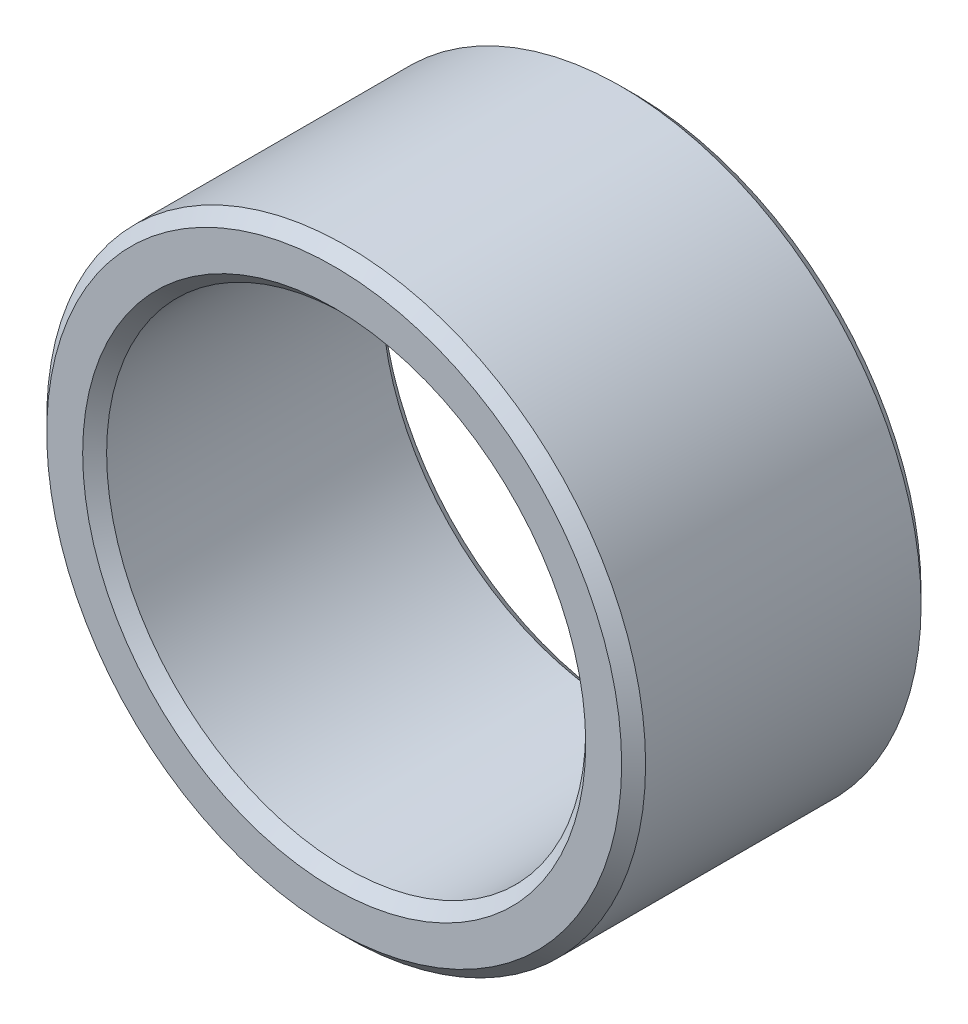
ISO-10303-21;
HEADER;
FILE_DESCRIPTION(('STEP AP214'),'2;1');
FILE_NAME('part.step','',(''),(''),'','','');
FILE_SCHEMA(('AUTOMOTIVE_DESIGN { 1 0 10303 214 1 1 1 1 }'));
ENDSEC;
DATA;
#1=APPLICATION_CONTEXT('core data for automotive mechanical design processes');
#2=APPLICATION_PROTOCOL_DEFINITION('international standard','automotive_design',2000,#1);
#3=PRODUCT_CONTEXT('',#1,'mechanical');
#4=PRODUCT('Part','Part','',(#3));
#5=PRODUCT_RELATED_PRODUCT_CATEGORY('part','',(#4));
#6=PRODUCT_DEFINITION_FORMATION('','',#4);
#7=PRODUCT_DEFINITION_CONTEXT('part definition',#1,'design');
#8=PRODUCT_DEFINITION('design','',#6,#7);
#9=PRODUCT_DEFINITION_SHAPE('','',#8);
#10=(LENGTH_UNIT() NAMED_UNIT(*) SI_UNIT(.MILLI.,.METRE.));
#11=(NAMED_UNIT(*) PLANE_ANGLE_UNIT() SI_UNIT($,.RADIAN.));
#12=(NAMED_UNIT(*) SI_UNIT($,.STERADIAN.) SOLID_ANGLE_UNIT());
#13=UNCERTAINTY_MEASURE_WITH_UNIT(LENGTH_MEASURE(1.E-05),#10,'distance_accuracy_value','');
#14=(GEOMETRIC_REPRESENTATION_CONTEXT(3) GLOBAL_UNCERTAINTY_ASSIGNED_CONTEXT((#13)) GLOBAL_UNIT_ASSIGNED_CONTEXT((#10,
#11,#12)) REPRESENTATION_CONTEXT('',''));
#15=CARTESIAN_POINT('',(0.,0.,0.));
#16=DIRECTION('',(0.,0.,1.));
#17=DIRECTION('',(1.,0.,0.));
#18=AXIS2_PLACEMENT_3D('',#15,#16,#17);
#19=CARTESIAN_POINT('',(0.,0.,25.));
#20=DIRECTION('',(0.,0.,1.));
#21=DIRECTION('',(1.,0.,0.));
#22=AXIS2_PLACEMENT_3D('',#19,#20,#21);
#23=PLANE('',#22);
#24=CARTESIAN_POINT('',(0.,0.,25.));
#25=DIRECTION('',(0.,0.,1.));
#26=DIRECTION('',(1.,0.,0.));
#27=AXIS2_PLACEMENT_3D('',#24,#25,#26);
#28=CIRCLE('',#27,24.);
#29=CARTESIAN_POINT('',(24.,0.,25.));
#30=VERTEX_POINT('',#29);
#31=EDGE_CURVE('E10',#30,#30,#28,.T.);
#32=ORIENTED_EDGE('',*,*,#31,.T.);
#33=EDGE_LOOP('',(#32));
#34=FACE_BOUND('',#33,.T.);
#35=CARTESIAN_POINT('',(0.,0.,25.));
#36=DIRECTION('',(0.,0.,1.));
#37=DIRECTION('',(1.,0.,0.));
#38=AXIS2_PLACEMENT_3D('',#35,#36,#37);
#39=CIRCLE('',#38,21.);
#40=CARTESIAN_POINT('',(21.,0.,25.));
#41=VERTEX_POINT('',#40);
#42=EDGE_CURVE('E32',#41,#41,#39,.F.);
#43=ORIENTED_EDGE('',*,*,#42,.T.);
#44=EDGE_LOOP('',(#43));
#45=FACE_BOUND('',#44,.T.);
#46=ADVANCED_FACE('F25',(#34,#45),#23,.T.);
#47=CARTESIAN_POINT('',(0.,0.,0.));
#48=DIRECTION('',(0.,0.,1.));
#49=DIRECTION('',(1.,0.,0.));
#50=AXIS2_PLACEMENT_3D('',#47,#48,#49);
#51=PLANE('',#50);
#52=CARTESIAN_POINT('',(0.,0.,0.));
#53=DIRECTION('',(0.,0.,1.));
#54=DIRECTION('',(1.,0.,0.));
#55=AXIS2_PLACEMENT_3D('',#52,#53,#54);
#56=CIRCLE('',#55,21.);
#57=CARTESIAN_POINT('',(21.,0.,0.));
#58=VERTEX_POINT('',#57);
#59=EDGE_CURVE('E51',#58,#58,#56,.T.);
#60=ORIENTED_EDGE('',*,*,#59,.T.);
#61=EDGE_LOOP('',(#60));
#62=FACE_BOUND('',#61,.T.);
#63=CARTESIAN_POINT('',(0.,0.,0.));
#64=DIRECTION('',(0.,0.,1.));
#65=DIRECTION('',(1.,0.,0.));
#66=AXIS2_PLACEMENT_3D('',#63,#64,#65);
#67=CIRCLE('',#66,24.);
#68=CARTESIAN_POINT('',(24.,0.,0.));
#69=VERTEX_POINT('',#68);
#70=EDGE_CURVE('E54',#69,#69,#67,.F.);
#71=ORIENTED_EDGE('',*,*,#70,.T.);
#72=EDGE_LOOP('',(#71));
#73=FACE_BOUND('',#72,.T.);
#74=ADVANCED_FACE('F58',(#62,#73),#51,.F.);
#75=CARTESIAN_POINT('',(0.,0.,25.));
#76=DIRECTION('',(0.,0.,-1.));
#77=DIRECTION('',(-1.,0.,0.));
#78=AXIS2_PLACEMENT_3D('',#75,#76,#77);
#79=CYLINDRICAL_SURFACE('',#78,25.);
#80=CARTESIAN_POINT('',(0.,0.,0.99999999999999));
#81=DIRECTION('',(0.,0.,1.));
#82=DIRECTION('',(1.,0.,0.));
#83=AXIS2_PLACEMENT_3D('',#80,#81,#82);
#84=CIRCLE('',#83,25.);
#85=CARTESIAN_POINT('',(25.,0.,0.99999999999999));
#86=VERTEX_POINT('',#85);
#87=EDGE_CURVE('E36',#86,#86,#84,.T.);
#88=ORIENTED_EDGE('',*,*,#87,.T.);
#89=EDGE_LOOP('',(#88));
#90=FACE_BOUND('',#89,.T.);
#91=CARTESIAN_POINT('',(0.,0.,24.));
#92=DIRECTION('',(0.,0.,1.));
#93=DIRECTION('',(1.,0.,0.));
#94=AXIS2_PLACEMENT_3D('',#91,#92,#93);
#95=CIRCLE('',#94,25.);
#96=CARTESIAN_POINT('',(25.,0.,24.));
#97=VERTEX_POINT('',#96);
#98=EDGE_CURVE('E40',#97,#97,#95,.F.);
#99=ORIENTED_EDGE('',*,*,#98,.T.);
#100=EDGE_LOOP('',(#99));
#101=FACE_BOUND('',#100,.T.);
#102=ADVANCED_FACE('F27',(#90,#101),#79,.T.);
#103=CARTESIAN_POINT('',(0.,0.,25.));
#104=DIRECTION('',(0.,0.,-1.));
#105=DIRECTION('',(-1.,0.,0.));
#106=AXIS2_PLACEMENT_3D('',#103,#104,#105);
#107=CYLINDRICAL_SURFACE('',#106,20.);
#108=CARTESIAN_POINT('',(0.,0.,1.));
#109=DIRECTION('',(0.,0.,1.));
#110=DIRECTION('',(1.,0.,0.));
#111=AXIS2_PLACEMENT_3D('',#108,#109,#110);
#112=CIRCLE('',#111,20.);
#113=CARTESIAN_POINT('',(20.,0.,1.));
#114=VERTEX_POINT('',#113);
#115=EDGE_CURVE('E45',#114,#114,#112,.F.);
#116=ORIENTED_EDGE('',*,*,#115,.T.);
#117=EDGE_LOOP('',(#116));
#118=FACE_BOUND('',#117,.T.);
#119=CARTESIAN_POINT('',(0.,0.,24.));
#120=DIRECTION('',(0.,0.,1.));
#121=DIRECTION('',(1.,0.,0.));
#122=AXIS2_PLACEMENT_3D('',#119,#120,#121);
#123=CIRCLE('',#122,20.);
#124=CARTESIAN_POINT('',(20.,0.,24.));
#125=VERTEX_POINT('',#124);
#126=EDGE_CURVE('E48',#125,#125,#123,.T.);
#127=ORIENTED_EDGE('',*,*,#126,.T.);
#128=EDGE_LOOP('',(#127));
#129=FACE_BOUND('',#128,.T.);
#130=ADVANCED_FACE('F70',(#118,#129),#107,.F.);
#131=CARTESIAN_POINT('',(0.,0.,0.));
#132=DIRECTION('',(0.,0.,-1.));
#133=DIRECTION('',(-1.,0.,0.));
#134=AXIS2_PLACEMENT_3D('',#131,#132,#133);
#135=CONICAL_SURFACE('',#134,21.,0.785398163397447);
#136=ORIENTED_EDGE('',*,*,#115,.F.);
#137=EDGE_LOOP('',(#136));
#138=FACE_BOUND('',#137,.T.);
#139=ORIENTED_EDGE('',*,*,#59,.F.);
#140=EDGE_LOOP('',(#139));
#141=FACE_BOUND('',#140,.T.);
#142=ADVANCED_FACE('F64',(#138,#141),#135,.F.);
#143=CARTESIAN_POINT('',(0.,0.,0.99999999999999));
#144=DIRECTION('',(0.,0.,1.));
#145=DIRECTION('',(1.,0.,0.));
#146=AXIS2_PLACEMENT_3D('',#143,#144,#145);
#147=CONICAL_SURFACE('',#146,25.,0.785398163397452);
#148=ORIENTED_EDGE('',*,*,#70,.F.);
#149=EDGE_LOOP('',(#148));
#150=FACE_BOUND('',#149,.T.);
#151=ORIENTED_EDGE('',*,*,#87,.F.);
#152=EDGE_LOOP('',(#151));
#153=FACE_BOUND('',#152,.T.);
#154=ADVANCED_FACE('F60',(#150,#153),#147,.T.);
#155=CARTESIAN_POINT('',(0.,0.,25.));
#156=DIRECTION('',(0.,0.,-1.));
#157=DIRECTION('',(-1.,0.,0.));
#158=AXIS2_PLACEMENT_3D('',#155,#156,#157);
#159=CONICAL_SURFACE('',#158,24.,0.785398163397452);
#160=ORIENTED_EDGE('',*,*,#98,.F.);
#161=EDGE_LOOP('',(#160));
#162=FACE_BOUND('',#161,.T.);
#163=ORIENTED_EDGE('',*,*,#31,.F.);
#164=EDGE_LOOP('',(#163));
#165=FACE_BOUND('',#164,.T.);
#166=ADVANCED_FACE('F63',(#162,#165),#159,.T.);
#167=CARTESIAN_POINT('',(0.,0.,24.));
#168=DIRECTION('',(0.,0.,1.));
#169=DIRECTION('',(1.,0.,0.));
#170=AXIS2_PLACEMENT_3D('',#167,#168,#169);
#171=CONICAL_SURFACE('',#170,20.,0.785398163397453);
#172=ORIENTED_EDGE('',*,*,#42,.F.);
#173=EDGE_LOOP('',(#172));
#174=FACE_BOUND('',#173,.T.);
#175=ORIENTED_EDGE('',*,*,#126,.F.);
#176=EDGE_LOOP('',(#175));
#177=FACE_BOUND('',#176,.T.);
#178=ADVANCED_FACE('F75',(#174,#177),#171,.F.);
#179=CLOSED_SHELL('',(#46,#74,#102,#130,#142,#154,#166,#178));
#180=MANIFOLD_SOLID_BREP('B2',#179);
#181=ADVANCED_BREP_SHAPE_REPRESENTATION('',(#18,#180),#14);
#182=SHAPE_DEFINITION_REPRESENTATION(#9,#181);
ENDSEC;
END-ISO-10303-21;
